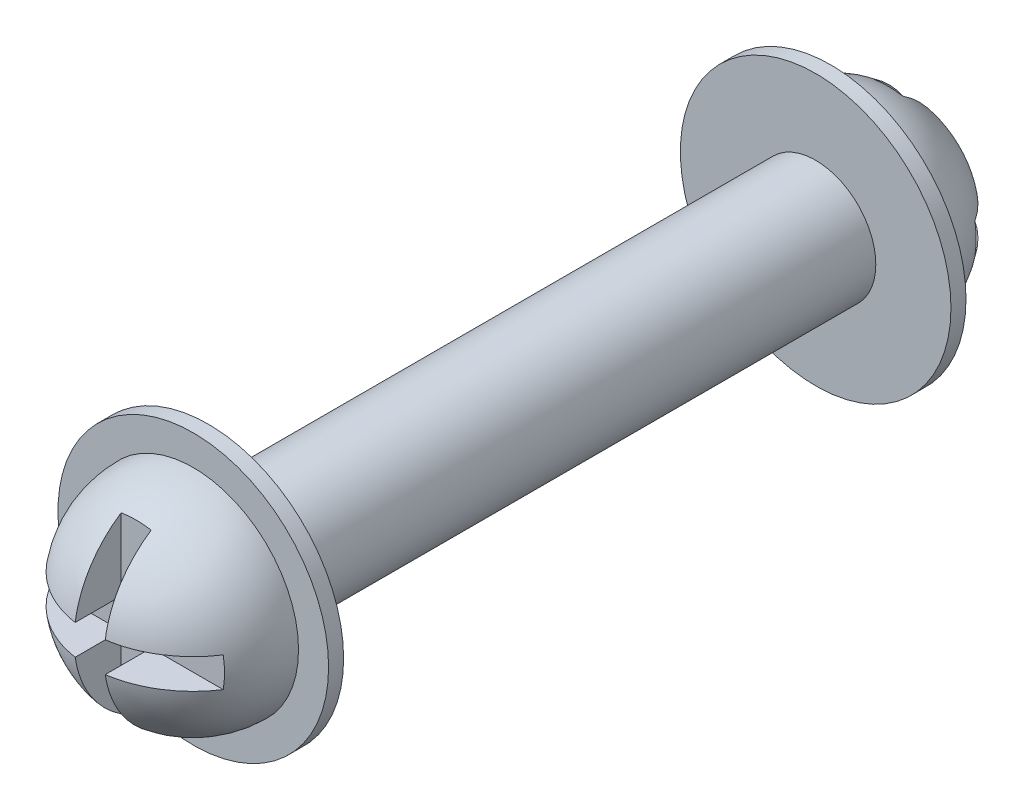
ISO-10303-21;
HEADER;
FILE_DESCRIPTION(('STEP AP214'),'2;1');
FILE_NAME('part.step','',(''),(''),'','','');
FILE_SCHEMA(('AUTOMOTIVE_DESIGN { 1 0 10303 214 1 1 1 1 }'));
ENDSEC;
DATA;
#1=APPLICATION_CONTEXT('core data for automotive mechanical design processes');
#2=APPLICATION_PROTOCOL_DEFINITION('international standard','automotive_design',2000,#1);
#3=PRODUCT_CONTEXT('',#1,'mechanical');
#4=PRODUCT('Part','Part','',(#3));
#5=PRODUCT_RELATED_PRODUCT_CATEGORY('part','',(#4));
#6=PRODUCT_DEFINITION_FORMATION('','',#4);
#7=PRODUCT_DEFINITION_CONTEXT('part definition',#1,'design');
#8=PRODUCT_DEFINITION('design','',#6,#7);
#9=PRODUCT_DEFINITION_SHAPE('','',#8);
#10=(LENGTH_UNIT() NAMED_UNIT(*) SI_UNIT(.MILLI.,.METRE.));
#11=(NAMED_UNIT(*) PLANE_ANGLE_UNIT() SI_UNIT($,.RADIAN.));
#12=(NAMED_UNIT(*) SI_UNIT($,.STERADIAN.) SOLID_ANGLE_UNIT());
#13=UNCERTAINTY_MEASURE_WITH_UNIT(LENGTH_MEASURE(1.E-05),#10,'distance_accuracy_value','');
#14=(GEOMETRIC_REPRESENTATION_CONTEXT(3) GLOBAL_UNCERTAINTY_ASSIGNED_CONTEXT((#13)) GLOBAL_UNIT_ASSIGNED_CONTEXT((#10,
#11,#12)) REPRESENTATION_CONTEXT('',''));
#15=CARTESIAN_POINT('',(0.,0.,0.));
#16=DIRECTION('',(0.,0.,1.));
#17=DIRECTION('',(1.,0.,0.));
#18=AXIS2_PLACEMENT_3D('',#15,#16,#17);
#19=CARTESIAN_POINT('',(-14.2875,1.58749999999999,-46.0375));
#20=DIRECTION('',(0.,1.,0.));
#21=DIRECTION('',(0.,0.,1.));
#22=AXIS2_PLACEMENT_3D('',#19,#20,#21);
#23=PLANE('',#22);
#24=CARTESIAN_POINT('',(0.,1.58749999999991,-33.655));
#25=DIRECTION('',(0.,1.,0.));
#26=DIRECTION('',(0.,0.,1.));
#27=AXIS2_PLACEMENT_3D('',#24,#25,#26);
#28=CIRCLE('',#27,10.9985226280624);
#29=CARTESIAN_POINT('',(-1.5875,1.58749999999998,-44.5383516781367));
#30=VERTEX_POINT('',#29);
#31=CARTESIAN_POINT('',(-9.19654520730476,1.58749999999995,-39.6875));
#32=VERTEX_POINT('',#31);
#33=EDGE_CURVE('E261',#30,#32,#28,.T.);
#34=ORIENTED_EDGE('',*,*,#33,.F.);
#35=DIRECTION('',(0.,0.,1.));
#36=VECTOR('',#35,1.);
#37=CARTESIAN_POINT('',(-1.58749999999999,1.58749999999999,-46.0375));
#38=LINE('',#37,#36);
#39=CARTESIAN_POINT('',(-1.58750000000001,1.58749999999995,-39.6875));
#40=VERTEX_POINT('',#39);
#41=EDGE_CURVE('E174',#30,#40,#38,.T.);
#42=ORIENTED_EDGE('',*,*,#41,.T.);
#43=DIRECTION('',(1.,0.,0.));
#44=VECTOR('',#43,1.);
#45=CARTESIAN_POINT('',(-14.2875,1.58749999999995,-39.6875));
#46=LINE('',#45,#44);
#47=EDGE_CURVE('E207',#32,#40,#46,.T.);
#48=ORIENTED_EDGE('',*,*,#47,.F.);
#49=EDGE_LOOP('',(#34,#42,#48));
#50=FACE_BOUND('',#49,.T.);
#51=ADVANCED_FACE('F32',(#50),#23,.F.);
#52=CARTESIAN_POINT('',(-14.2875,-1.58749999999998,-46.0375));
#53=DIRECTION('',(0.,-1.,0.));
#54=DIRECTION('',(0.,0.,-1.));
#55=AXIS2_PLACEMENT_3D('',#52,#53,#54);
#56=PLANE('',#55);
#57=DIRECTION('',(1.,0.,0.));
#58=VECTOR('',#57,1.);
#59=CARTESIAN_POINT('',(-14.2875,-1.58749999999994,-39.6875));
#60=LINE('',#59,#58);
#61=CARTESIAN_POINT('',(-9.19654520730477,-1.58749999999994,-39.6875));
#62=VERTEX_POINT('',#61);
#63=CARTESIAN_POINT('',(-1.58750000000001,-1.58749999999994,-39.6875));
#64=VERTEX_POINT('',#63);
#65=EDGE_CURVE('E203',#62,#64,#60,.T.);
#66=ORIENTED_EDGE('',*,*,#65,.T.);
#67=DIRECTION('',(0.,0.,-1.));
#68=VECTOR('',#67,1.);
#69=CARTESIAN_POINT('',(-1.58749999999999,-1.58749999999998,-46.0375));
#70=LINE('',#69,#68);
#71=CARTESIAN_POINT('',(-1.5875,-1.58749999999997,-44.5383516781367));
#72=VERTEX_POINT('',#71);
#73=EDGE_CURVE('E276',#64,#72,#70,.T.);
#74=ORIENTED_EDGE('',*,*,#73,.T.);
#75=CARTESIAN_POINT('',(0.,-1.5874999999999,-33.655));
#76=DIRECTION('',(0.,-1.,0.));
#77=DIRECTION('',(0.,0.,-1.));
#78=AXIS2_PLACEMENT_3D('',#75,#76,#77);
#79=CIRCLE('',#78,10.9985226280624);
#80=EDGE_CURVE('E259',#62,#72,#79,.T.);
#81=ORIENTED_EDGE('',*,*,#80,.F.);
#82=EDGE_LOOP('',(#66,#74,#81));
#83=FACE_BOUND('',#82,.T.);
#84=ADVANCED_FACE('F339',(#83),#56,.F.);
#85=CARTESIAN_POINT('',(-14.2875,1.58749999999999,46.0375));
#86=DIRECTION('',(0.,1.,0.));
#87=DIRECTION('',(0.,0.,1.));
#88=AXIS2_PLACEMENT_3D('',#85,#86,#87);
#89=PLANE('',#88);
#90=DIRECTION('',(1.,0.,0.));
#91=VECTOR('',#90,1.);
#92=CARTESIAN_POINT('',(-14.2875,1.58749999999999,39.6875));
#93=LINE('',#92,#91);
#94=CARTESIAN_POINT('',(-9.19654520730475,1.58749999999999,39.6875));
#95=VERTEX_POINT('',#94);
#96=CARTESIAN_POINT('',(-1.58749999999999,1.5875,39.6875));
#97=VERTEX_POINT('',#96);
#98=EDGE_CURVE('E211',#95,#97,#93,.T.);
#99=ORIENTED_EDGE('',*,*,#98,.T.);
#100=DIRECTION('',(0.,0.,1.));
#101=VECTOR('',#100,1.);
#102=CARTESIAN_POINT('',(-1.58749999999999,1.58749999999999,46.0375));
#103=LINE('',#102,#101);
#104=CARTESIAN_POINT('',(-1.58749999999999,1.58749999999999,44.5383516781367));
#105=VERTEX_POINT('',#104);
#106=EDGE_CURVE('E199',#97,#105,#103,.T.);
#107=ORIENTED_EDGE('',*,*,#106,.T.);
#108=CARTESIAN_POINT('',(0.,1.58749999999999,33.655));
#109=DIRECTION('',(0.,1.,0.));
#110=DIRECTION('',(0.,0.,1.));
#111=AXIS2_PLACEMENT_3D('',#108,#109,#110);
#112=CIRCLE('',#111,10.9985226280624);
#113=EDGE_CURVE('E250',#95,#105,#112,.T.);
#114=ORIENTED_EDGE('',*,*,#113,.F.);
#115=EDGE_LOOP('',(#99,#107,#114));
#116=FACE_BOUND('',#115,.T.);
#117=ADVANCED_FACE('F301',(#116),#89,.F.);
#118=CARTESIAN_POINT('',(-14.2875,-1.58750000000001,46.0375));
#119=DIRECTION('',(0.,-1.,0.));
#120=DIRECTION('',(0.,0.,-1.));
#121=AXIS2_PLACEMENT_3D('',#118,#119,#120);
#122=PLANE('',#121);
#123=CARTESIAN_POINT('',(0.,-1.58749999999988,33.655));
#124=DIRECTION('',(0.,-1.,0.));
#125=DIRECTION('',(0.,0.,-1.));
#126=AXIS2_PLACEMENT_3D('',#123,#124,#125);
#127=CIRCLE('',#126,10.9985226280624);
#128=CARTESIAN_POINT('',(-1.58749999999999,-1.58749999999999,44.5383516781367));
#129=VERTEX_POINT('',#128);
#130=CARTESIAN_POINT('',(-9.19654520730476,-1.58749999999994,39.6875));
#131=VERTEX_POINT('',#130);
#132=EDGE_CURVE('E242',#129,#131,#127,.T.);
#133=ORIENTED_EDGE('',*,*,#132,.F.);
#134=DIRECTION('',(0.,0.,-1.));
#135=VECTOR('',#134,1.);
#136=CARTESIAN_POINT('',(-1.58749999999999,-1.58750000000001,46.0375));
#137=LINE('',#136,#135);
#138=CARTESIAN_POINT('',(-1.58749999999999,-1.58749999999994,39.6875));
#139=VERTEX_POINT('',#138);
#140=EDGE_CURVE('E11',#129,#139,#137,.T.);
#141=ORIENTED_EDGE('',*,*,#140,.T.);
#142=DIRECTION('',(1.,0.,0.));
#143=VECTOR('',#142,1.);
#144=CARTESIAN_POINT('',(-14.2875,-1.58749999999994,39.6875));
#145=LINE('',#144,#143);
#146=EDGE_CURVE('E216',#131,#139,#145,.T.);
#147=ORIENTED_EDGE('',*,*,#146,.F.);
#148=EDGE_LOOP('',(#133,#141,#147));
#149=FACE_BOUND('',#148,.T.);
#150=ADVANCED_FACE('F310',(#149),#122,.F.);
#151=CARTESIAN_POINT('',(0.,11.1125,-33.655));
#152=DIRECTION('',(0.,0.,1.));
#153=DIRECTION('',(1.,0.,0.));
#154=AXIS2_PLACEMENT_3D('',#151,#152,#153);
#155=PLANE('',#154);
#156=CARTESIAN_POINT('',(0.,0.,-33.655));
#157=DIRECTION('',(0.,0.,1.));
#158=DIRECTION('',(1.,0.,0.));
#159=AXIS2_PLACEMENT_3D('',#156,#157,#158);
#160=CIRCLE('',#159,14.2875);
#161=CARTESIAN_POINT('',(14.2875,0.,-33.655));
#162=VERTEX_POINT('',#161);
#163=EDGE_CURVE('E239',#162,#162,#160,.T.);
#164=ORIENTED_EDGE('',*,*,#163,.F.);
#165=EDGE_LOOP('',(#164));
#166=FACE_BOUND('',#165,.T.);
#167=CARTESIAN_POINT('',(0.,0.,-33.655));
#168=DIRECTION('',(0.,0.,1.));
#169=DIRECTION('',(1.,0.,0.));
#170=AXIS2_PLACEMENT_3D('',#167,#168,#169);
#171=CIRCLE('',#170,11.1125);
#172=CARTESIAN_POINT('',(11.1125,0.,-33.655));
#173=VERTEX_POINT('',#172);
#174=EDGE_CURVE('E214',#173,#173,#171,.T.);
#175=ORIENTED_EDGE('',*,*,#174,.T.);
#176=EDGE_LOOP('',(#175));
#177=FACE_BOUND('',#176,.T.);
#178=ADVANCED_FACE('F34',(#166,#177),#155,.F.);
#179=CARTESIAN_POINT('',(0.,0.,77.1786132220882));
#180=DIRECTION('',(0.,0.,1.));
#181=DIRECTION('',(1.,0.,0.));
#182=AXIS2_PLACEMENT_3D('',#179,#180,#181);
#183=CYLINDRICAL_SURFACE('',#182,14.2875);
#184=CARTESIAN_POINT('',(0.,0.,-32.0675));
#185=DIRECTION('',(0.,0.,1.));
#186=DIRECTION('',(1.,0.,0.));
#187=AXIS2_PLACEMENT_3D('',#184,#185,#186);
#188=CIRCLE('',#187,14.2875);
#189=CARTESIAN_POINT('',(14.2875,0.,-32.0675));
#190=VERTEX_POINT('',#189);
#191=EDGE_CURVE('E236',#190,#190,#188,.T.);
#192=ORIENTED_EDGE('',*,*,#191,.F.);
#193=EDGE_LOOP('',(#192));
#194=FACE_BOUND('',#193,.T.);
#195=ORIENTED_EDGE('',*,*,#163,.T.);
#196=EDGE_LOOP('',(#195));
#197=FACE_BOUND('',#196,.T.);
#198=ADVANCED_FACE('F365',(#194,#197),#183,.T.);
#199=CARTESIAN_POINT('',(0.,6.35,-32.0675));
#200=DIRECTION('',(0.,0.,-1.));
#201=DIRECTION('',(-1.,0.,0.));
#202=AXIS2_PLACEMENT_3D('',#199,#200,#201);
#203=PLANE('',#202);
#204=CARTESIAN_POINT('',(0.,0.,-32.0675));
#205=DIRECTION('',(0.,0.,1.));
#206=DIRECTION('',(1.,0.,0.));
#207=AXIS2_PLACEMENT_3D('',#204,#205,#206);
#208=CIRCLE('',#207,6.35);
#209=CARTESIAN_POINT('',(6.35,0.,-32.0675));
#210=VERTEX_POINT('',#209);
#211=EDGE_CURVE('E233',#210,#210,#208,.T.);
#212=ORIENTED_EDGE('',*,*,#211,.F.);
#213=EDGE_LOOP('',(#212));
#214=FACE_BOUND('',#213,.T.);
#215=ORIENTED_EDGE('',*,*,#191,.T.);
#216=EDGE_LOOP('',(#215));
#217=FACE_BOUND('',#216,.T.);
#218=ADVANCED_FACE('F393',(#214,#217),#203,.F.);
#219=CARTESIAN_POINT('',(0.,0.,77.1786132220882));
#220=DIRECTION('',(0.,0.,1.));
#221=DIRECTION('',(1.,0.,0.));
#222=AXIS2_PLACEMENT_3D('',#219,#220,#221);
#223=CYLINDRICAL_SURFACE('',#222,6.35);
#224=CARTESIAN_POINT('',(0.,0.,32.0675));
#225=DIRECTION('',(0.,0.,1.));
#226=DIRECTION('',(1.,0.,0.));
#227=AXIS2_PLACEMENT_3D('',#224,#225,#226);
#228=CIRCLE('',#227,6.35);
#229=CARTESIAN_POINT('',(6.35,0.,32.0675));
#230=VERTEX_POINT('',#229);
#231=EDGE_CURVE('E230',#230,#230,#228,.T.);
#232=ORIENTED_EDGE('',*,*,#231,.F.);
#233=EDGE_LOOP('',(#232));
#234=FACE_BOUND('',#233,.T.);
#235=ORIENTED_EDGE('',*,*,#211,.T.);
#236=EDGE_LOOP('',(#235));
#237=FACE_BOUND('',#236,.T.);
#238=ADVANCED_FACE('F389',(#234,#237),#223,.T.);
#239=CARTESIAN_POINT('',(0.,6.35,32.0675));
#240=DIRECTION('',(0.,0.,1.));
#241=DIRECTION('',(1.,0.,0.));
#242=AXIS2_PLACEMENT_3D('',#239,#240,#241);
#243=PLANE('',#242);
#244=CARTESIAN_POINT('',(0.,0.,32.0675));
#245=DIRECTION('',(0.,0.,1.));
#246=DIRECTION('',(1.,0.,0.));
#247=AXIS2_PLACEMENT_3D('',#244,#245,#246);
#248=CIRCLE('',#247,14.2875);
#249=CARTESIAN_POINT('',(14.2875,0.,32.0675));
#250=VERTEX_POINT('',#249);
#251=EDGE_CURVE('E227',#250,#250,#248,.T.);
#252=ORIENTED_EDGE('',*,*,#251,.F.);
#253=EDGE_LOOP('',(#252));
#254=FACE_BOUND('',#253,.T.);
#255=ORIENTED_EDGE('',*,*,#231,.T.);
#256=EDGE_LOOP('',(#255));
#257=FACE_BOUND('',#256,.T.);
#258=ADVANCED_FACE('F385',(#254,#257),#243,.F.);
#259=CARTESIAN_POINT('',(0.,0.,77.1786132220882));
#260=DIRECTION('',(0.,0.,1.));
#261=DIRECTION('',(1.,0.,0.));
#262=AXIS2_PLACEMENT_3D('',#259,#260,#261);
#263=CYLINDRICAL_SURFACE('',#262,14.2875);
#264=CARTESIAN_POINT('',(0.,0.,33.655));
#265=DIRECTION('',(0.,0.,1.));
#266=DIRECTION('',(1.,0.,0.));
#267=AXIS2_PLACEMENT_3D('',#264,#265,#266);
#268=CIRCLE('',#267,14.2875);
#269=CARTESIAN_POINT('',(14.2875,0.,33.655));
#270=VERTEX_POINT('',#269);
#271=EDGE_CURVE('E224',#270,#270,#268,.T.);
#272=ORIENTED_EDGE('',*,*,#271,.F.);
#273=EDGE_LOOP('',(#272));
#274=FACE_BOUND('',#273,.T.);
#275=ORIENTED_EDGE('',*,*,#251,.T.);
#276=EDGE_LOOP('',(#275));
#277=FACE_BOUND('',#276,.T.);
#278=ADVANCED_FACE('F381',(#274,#277),#263,.T.);
#279=CARTESIAN_POINT('',(0.,11.1125,33.655));
#280=DIRECTION('',(0.,0.,-1.));
#281=DIRECTION('',(-1.,0.,0.));
#282=AXIS2_PLACEMENT_3D('',#279,#280,#281);
#283=PLANE('',#282);
#284=CARTESIAN_POINT('',(0.,0.,33.655));
#285=DIRECTION('',(0.,0.,1.));
#286=DIRECTION('',(1.,0.,0.));
#287=AXIS2_PLACEMENT_3D('',#284,#285,#286);
#288=CIRCLE('',#287,11.1125);
#289=CARTESIAN_POINT('',(11.1125,0.,33.655));
#290=VERTEX_POINT('',#289);
#291=EDGE_CURVE('E221',#290,#290,#288,.T.);
#292=ORIENTED_EDGE('',*,*,#291,.F.);
#293=EDGE_LOOP('',(#292));
#294=FACE_BOUND('',#293,.T.);
#295=ORIENTED_EDGE('',*,*,#271,.T.);
#296=EDGE_LOOP('',(#295));
#297=FACE_BOUND('',#296,.T.);
#298=ADVANCED_FACE('F376',(#294,#297),#283,.F.);
#299=CARTESIAN_POINT('',(0.,0.,33.655));
#300=DIRECTION('',(0.,0.,1.));
#301=DIRECTION('',(0.,1.,0.));
#302=AXIS2_PLACEMENT_3D('',#299,#300,#301);
#303=SPHERICAL_SURFACE('',#302,11.1125);
#304=ORIENTED_EDGE('',*,*,#113,.T.);
#305=CARTESIAN_POINT('',(-1.58749999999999,0.,33.655));
#306=DIRECTION('',(-1.,0.,0.));
#307=DIRECTION('',(0.,0.,1.));
#308=AXIS2_PLACEMENT_3D('',#305,#306,#307);
#309=CIRCLE('',#308,10.9985226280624);
#310=CARTESIAN_POINT('',(-1.58749999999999,9.19654520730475,39.6875));
#311=VERTEX_POINT('',#310);
#312=EDGE_CURVE('E200',#105,#311,#309,.T.);
#313=ORIENTED_EDGE('',*,*,#312,.T.);
#314=CARTESIAN_POINT('',(0.,0.,39.6875));
#315=DIRECTION('',(0.,0.,-1.));
#316=DIRECTION('',(-1.,0.,0.));
#317=AXIS2_PLACEMENT_3D('',#314,#315,#316);
#318=CIRCLE('',#317,9.33255592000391);
#319=CARTESIAN_POINT('',(1.58750000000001,9.19654520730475,39.6875));
#320=VERTEX_POINT('',#319);
#321=EDGE_CURVE('E195',#311,#320,#318,.T.);
#322=ORIENTED_EDGE('',*,*,#321,.T.);
#323=CARTESIAN_POINT('',(1.58750000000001,0.,33.655));
#324=DIRECTION('',(1.,0.,0.));
#325=DIRECTION('',(0.,0.,-1.));
#326=AXIS2_PLACEMENT_3D('',#323,#324,#325);
#327=CIRCLE('',#326,10.9985226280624);
#328=CARTESIAN_POINT('',(1.58750000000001,1.58749999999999,44.5383516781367));
#329=VERTEX_POINT('',#328);
#330=EDGE_CURVE('E189',#320,#329,#327,.T.);
#331=ORIENTED_EDGE('',*,*,#330,.T.);
#332=CARTESIAN_POINT('',(9.19654520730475,1.58749999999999,39.6875));
#333=VERTEX_POINT('',#332);
#334=EDGE_CURVE('E254',#329,#333,#112,.T.);
#335=ORIENTED_EDGE('',*,*,#334,.T.);
#336=CARTESIAN_POINT('',(0.,0.,39.6875));
#337=DIRECTION('',(0.,0.,-1.));
#338=DIRECTION('',(-1.,0.,0.));
#339=AXIS2_PLACEMENT_3D('',#336,#337,#338);
#340=CIRCLE('',#339,9.33255592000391);
#341=CARTESIAN_POINT('',(9.19654520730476,-1.58749999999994,39.6875));
#342=VERTEX_POINT('',#341);
#343=EDGE_CURVE('E249',#333,#342,#340,.T.);
#344=ORIENTED_EDGE('',*,*,#343,.T.);
#345=CARTESIAN_POINT('',(1.58750000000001,-1.58749999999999,44.5383516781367));
#346=VERTEX_POINT('',#345);
#347=EDGE_CURVE('E243',#342,#346,#127,.T.);
#348=ORIENTED_EDGE('',*,*,#347,.T.);
#349=CARTESIAN_POINT('',(1.58750000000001,-9.19654520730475,39.6875));
#350=VERTEX_POINT('',#349);
#351=EDGE_CURVE('E185',#346,#350,#327,.T.);
#352=ORIENTED_EDGE('',*,*,#351,.T.);
#353=CARTESIAN_POINT('',(-1.58749999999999,-9.19654520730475,39.6875));
#354=VERTEX_POINT('',#353);
#355=EDGE_CURVE('E192',#350,#354,#318,.T.);
#356=ORIENTED_EDGE('',*,*,#355,.T.);
#357=EDGE_CURVE('E196',#354,#129,#309,.T.);
#358=ORIENTED_EDGE('',*,*,#357,.T.);
#359=ORIENTED_EDGE('',*,*,#132,.T.);
#360=EDGE_CURVE('E246',#131,#95,#340,.T.);
#361=ORIENTED_EDGE('',*,*,#360,.T.);
#362=EDGE_LOOP('',(#304,#313,#322,#331,#335,#344,#348,#352,#356,#358,#359,#361));
#363=FACE_BOUND('',#362,.T.);
#364=ORIENTED_EDGE('',*,*,#291,.T.);
#365=EDGE_LOOP('',(#364));
#366=FACE_BOUND('',#365,.T.);
#367=ADVANCED_FACE('F294',(#363,#366),#303,.T.);
#368=CARTESIAN_POINT('',(0.,0.,-33.655));
#369=DIRECTION('',(0.,0.,1.));
#370=DIRECTION('',(0.,-1.,0.));
#371=AXIS2_PLACEMENT_3D('',#368,#369,#370);
#372=SPHERICAL_SURFACE('',#371,11.1125);
#373=CARTESIAN_POINT('',(0.,0.,-39.6875));
#374=DIRECTION('',(0.,0.,1.));
#375=DIRECTION('',(1.,0.,0.));
#376=AXIS2_PLACEMENT_3D('',#373,#374,#375);
#377=CIRCLE('',#376,9.33255592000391);
#378=CARTESIAN_POINT('',(1.58750000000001,9.19654520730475,-39.6875));
#379=VERTEX_POINT('',#378);
#380=CARTESIAN_POINT('',(-1.58750000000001,9.19654520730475,-39.6875));
#381=VERTEX_POINT('',#380);
#382=EDGE_CURVE('E169',#379,#381,#377,.T.);
#383=ORIENTED_EDGE('',*,*,#382,.T.);
#384=CARTESIAN_POINT('',(-1.58750000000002,0.,-33.655));
#385=DIRECTION('',(-1.,0.,0.));
#386=DIRECTION('',(0.,0.,1.));
#387=AXIS2_PLACEMENT_3D('',#384,#385,#386);
#388=CIRCLE('',#387,10.9985226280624);
#389=EDGE_CURVE('E170',#381,#30,#388,.T.);
#390=ORIENTED_EDGE('',*,*,#389,.T.);
#391=ORIENTED_EDGE('',*,*,#33,.T.);
#392=CARTESIAN_POINT('',(0.,0.,-39.6875));
#393=DIRECTION('',(0.,0.,1.));
#394=DIRECTION('',(1.,0.,0.));
#395=AXIS2_PLACEMENT_3D('',#392,#393,#394);
#396=CIRCLE('',#395,9.33255592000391);
#397=EDGE_CURVE('E258',#32,#62,#396,.T.);
#398=ORIENTED_EDGE('',*,*,#397,.T.);
#399=ORIENTED_EDGE('',*,*,#80,.T.);
#400=CARTESIAN_POINT('',(-1.58750000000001,-9.19654520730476,-39.6875));
#401=VERTEX_POINT('',#400);
#402=EDGE_CURVE('E168',#72,#401,#388,.T.);
#403=ORIENTED_EDGE('',*,*,#402,.T.);
#404=CARTESIAN_POINT('',(1.58750000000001,-9.19654520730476,-39.6875));
#405=VERTEX_POINT('',#404);
#406=EDGE_CURVE('E158',#401,#405,#377,.T.);
#407=ORIENTED_EDGE('',*,*,#406,.T.);
#408=CARTESIAN_POINT('',(1.58750000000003,0.,-33.655));
#409=DIRECTION('',(1.,0.,0.));
#410=DIRECTION('',(0.,0.,-1.));
#411=AXIS2_PLACEMENT_3D('',#408,#409,#410);
#412=CIRCLE('',#411,10.9985226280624);
#413=CARTESIAN_POINT('',(1.5875,-1.58749999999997,-44.5383516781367));
#414=VERTEX_POINT('',#413);
#415=EDGE_CURVE('E144',#405,#414,#412,.T.);
#416=ORIENTED_EDGE('',*,*,#415,.T.);
#417=CARTESIAN_POINT('',(9.19654520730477,-1.58749999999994,-39.6875));
#418=VERTEX_POINT('',#417);
#419=EDGE_CURVE('E257',#414,#418,#79,.T.);
#420=ORIENTED_EDGE('',*,*,#419,.T.);
#421=CARTESIAN_POINT('',(9.19654520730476,1.58749999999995,-39.6875));
#422=VERTEX_POINT('',#421);
#423=EDGE_CURVE('E253',#418,#422,#396,.T.);
#424=ORIENTED_EDGE('',*,*,#423,.T.);
#425=CARTESIAN_POINT('',(1.5875,1.58749999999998,-44.5383516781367));
#426=VERTEX_POINT('',#425);
#427=EDGE_CURVE('E262',#422,#426,#28,.T.);
#428=ORIENTED_EDGE('',*,*,#427,.T.);
#429=EDGE_CURVE('E155',#426,#379,#412,.T.);
#430=ORIENTED_EDGE('',*,*,#429,.T.);
#431=EDGE_LOOP('',(#383,#390,#391,#398,#399,#403,#407,#416,#420,#424,#428,#430));
#432=FACE_BOUND('',#431,.T.);
#433=ORIENTED_EDGE('',*,*,#174,.F.);
#434=EDGE_LOOP('',(#433));
#435=FACE_BOUND('',#434,.T.);
#436=ADVANCED_FACE('F165',(#432,#435),#372,.T.);
#437=ORIENTED_EDGE('',*,*,#334,.F.);
#438=DIRECTION('',(0.,0.,-1.));
#439=VECTOR('',#438,1.);
#440=CARTESIAN_POINT('',(1.58750000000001,1.58749999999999,46.0375));
#441=LINE('',#440,#439);
#442=CARTESIAN_POINT('',(1.58750000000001,1.58749999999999,39.6875));
#443=VERTEX_POINT('',#442);
#444=EDGE_CURVE('E188',#329,#443,#441,.T.);
#445=ORIENTED_EDGE('',*,*,#444,.T.);
#446=EDGE_CURVE('E215',#443,#333,#93,.T.);
#447=ORIENTED_EDGE('',*,*,#446,.T.);
#448=EDGE_LOOP('',(#437,#445,#447));
#449=FACE_BOUND('',#448,.T.);
#450=ADVANCED_FACE('F323',(#449),#89,.F.);
#451=CARTESIAN_POINT('',(-14.2875,1.58749999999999,39.6875));
#452=DIRECTION('',(0.,0.,-1.));
#453=DIRECTION('',(-1.,0.,0.));
#454=AXIS2_PLACEMENT_3D('',#451,#452,#453);
#455=PLANE('',#454);
#456=ORIENTED_EDGE('',*,*,#446,.F.);
#457=DIRECTION('',(0.,1.,0.));
#458=VECTOR('',#457,1.);
#459=CARTESIAN_POINT('',(1.58750000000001,-14.2875,39.6875));
#460=LINE('',#459,#458);
#461=EDGE_CURVE('E172',#443,#320,#460,.T.);
#462=ORIENTED_EDGE('',*,*,#461,.T.);
#463=ORIENTED_EDGE('',*,*,#321,.F.);
#464=DIRECTION('',(0.,1.,0.));
#465=VECTOR('',#464,1.);
#466=CARTESIAN_POINT('',(-1.58749999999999,-14.2875,39.6875));
#467=LINE('',#466,#465);
#468=EDGE_CURVE('E178',#97,#311,#467,.T.);
#469=ORIENTED_EDGE('',*,*,#468,.F.);
#470=ORIENTED_EDGE('',*,*,#98,.F.);
#471=ORIENTED_EDGE('',*,*,#360,.F.);
#472=ORIENTED_EDGE('',*,*,#146,.T.);
#473=EDGE_CURVE('E181',#354,#139,#467,.T.);
#474=ORIENTED_EDGE('',*,*,#473,.F.);
#475=ORIENTED_EDGE('',*,*,#355,.F.);
#476=CARTESIAN_POINT('',(1.58750000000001,-1.58749999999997,39.6875));
#477=VERTEX_POINT('',#476);
#478=EDGE_CURVE('E182',#350,#477,#460,.T.);
#479=ORIENTED_EDGE('',*,*,#478,.T.);
#480=EDGE_CURVE('E206',#477,#342,#145,.T.);
#481=ORIENTED_EDGE('',*,*,#480,.T.);
#482=ORIENTED_EDGE('',*,*,#343,.F.);
#483=EDGE_LOOP('',(#456,#462,#463,#469,#470,#471,#472,#474,#475,#479,#481,#482));
#484=FACE_BOUND('',#483,.T.);
#485=ADVANCED_FACE('F306',(#484),#455,.F.);
#486=ORIENTED_EDGE('',*,*,#480,.F.);
#487=DIRECTION('',(0.,0.,1.));
#488=VECTOR('',#487,1.);
#489=CARTESIAN_POINT('',(1.58750000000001,-1.58750000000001,46.0375));
#490=LINE('',#489,#488);
#491=EDGE_CURVE('E40',#477,#346,#490,.T.);
#492=ORIENTED_EDGE('',*,*,#491,.T.);
#493=ORIENTED_EDGE('',*,*,#347,.F.);
#494=EDGE_LOOP('',(#486,#492,#493));
#495=FACE_BOUND('',#494,.T.);
#496=ADVANCED_FACE('F319',(#495),#122,.F.);
#497=CARTESIAN_POINT('',(1.58750000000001,1.58749999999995,-39.6875));
#498=VERTEX_POINT('',#497);
#499=EDGE_CURVE('E210',#498,#422,#46,.T.);
#500=ORIENTED_EDGE('',*,*,#499,.F.);
#501=DIRECTION('',(0.,0.,-1.));
#502=VECTOR('',#501,1.);
#503=CARTESIAN_POINT('',(1.58749999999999,1.58749999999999,-46.0375));
#504=LINE('',#503,#502);
#505=EDGE_CURVE('E153',#498,#426,#504,.T.);
#506=ORIENTED_EDGE('',*,*,#505,.T.);
#507=ORIENTED_EDGE('',*,*,#427,.F.);
#508=EDGE_LOOP('',(#500,#506,#507));
#509=FACE_BOUND('',#508,.T.);
#510=ADVANCED_FACE('F290',(#509),#23,.F.);
#511=ORIENTED_EDGE('',*,*,#419,.F.);
#512=DIRECTION('',(0.,0.,1.));
#513=VECTOR('',#512,1.);
#514=CARTESIAN_POINT('',(1.58749999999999,-1.58749999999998,-46.0375));
#515=LINE('',#514,#513);
#516=CARTESIAN_POINT('',(1.58750000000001,-1.58749999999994,-39.6875));
#517=VERTEX_POINT('',#516);
#518=EDGE_CURVE('E149',#414,#517,#515,.T.);
#519=ORIENTED_EDGE('',*,*,#518,.T.);
#520=EDGE_CURVE('E161',#517,#418,#60,.T.);
#521=ORIENTED_EDGE('',*,*,#520,.T.);
#522=EDGE_LOOP('',(#511,#519,#521));
#523=FACE_BOUND('',#522,.T.);
#524=ADVANCED_FACE('F345',(#523),#56,.F.);
#525=CARTESIAN_POINT('',(-14.2875,1.58749999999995,-39.6875));
#526=DIRECTION('',(0.,0.,1.));
#527=DIRECTION('',(1.,0.,0.));
#528=AXIS2_PLACEMENT_3D('',#525,#526,#527);
#529=PLANE('',#528);
#530=ORIENTED_EDGE('',*,*,#520,.F.);
#531=DIRECTION('',(0.,1.,0.));
#532=VECTOR('',#531,1.);
#533=CARTESIAN_POINT('',(1.58750000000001,-14.2875,-39.6875));
#534=LINE('',#533,#532);
#535=EDGE_CURVE('E147',#405,#517,#534,.T.);
#536=ORIENTED_EDGE('',*,*,#535,.F.);
#537=ORIENTED_EDGE('',*,*,#406,.F.);
#538=DIRECTION('',(0.,1.,0.));
#539=VECTOR('',#538,1.);
#540=CARTESIAN_POINT('',(-1.58750000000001,-14.2875,-39.6875));
#541=LINE('',#540,#539);
#542=EDGE_CURVE('E47',#401,#64,#541,.T.);
#543=ORIENTED_EDGE('',*,*,#542,.T.);
#544=ORIENTED_EDGE('',*,*,#65,.F.);
#545=ORIENTED_EDGE('',*,*,#397,.F.);
#546=ORIENTED_EDGE('',*,*,#47,.T.);
#547=EDGE_CURVE('E283',#40,#381,#541,.T.);
#548=ORIENTED_EDGE('',*,*,#547,.T.);
#549=ORIENTED_EDGE('',*,*,#382,.F.);
#550=EDGE_CURVE('E54',#498,#379,#534,.T.);
#551=ORIENTED_EDGE('',*,*,#550,.F.);
#552=ORIENTED_EDGE('',*,*,#499,.T.);
#553=ORIENTED_EDGE('',*,*,#423,.F.);
#554=EDGE_LOOP('',(#530,#536,#537,#543,#544,#545,#546,#548,#549,#551,#552,#553));
#555=FACE_BOUND('',#554,.T.);
#556=ADVANCED_FACE('F157',(#555),#529,.F.);
#557=CARTESIAN_POINT('',(1.58750000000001,-14.2875,47.3075));
#558=DIRECTION('',(1.,0.,0.));
#559=DIRECTION('',(0.,0.,-1.));
#560=AXIS2_PLACEMENT_3D('',#557,#558,#559);
#561=PLANE('',#560);
#562=ORIENTED_EDGE('',*,*,#491,.F.);
#563=ORIENTED_EDGE('',*,*,#478,.F.);
#564=ORIENTED_EDGE('',*,*,#351,.F.);
#565=EDGE_LOOP('',(#562,#563,#564));
#566=FACE_BOUND('',#565,.T.);
#567=ADVANCED_FACE('F317',(#566),#561,.F.);
#568=CARTESIAN_POINT('',(-1.58749999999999,-14.2875,47.3075));
#569=DIRECTION('',(-1.,0.,0.));
#570=DIRECTION('',(0.,0.,1.));
#571=AXIS2_PLACEMENT_3D('',#568,#569,#570);
#572=PLANE('',#571);
#573=ORIENTED_EDGE('',*,*,#473,.T.);
#574=ORIENTED_EDGE('',*,*,#140,.F.);
#575=ORIENTED_EDGE('',*,*,#357,.F.);
#576=EDGE_LOOP('',(#573,#574,#575));
#577=FACE_BOUND('',#576,.T.);
#578=ADVANCED_FACE('F334',(#577),#572,.F.);
#579=ORIENTED_EDGE('',*,*,#106,.F.);
#580=ORIENTED_EDGE('',*,*,#468,.T.);
#581=ORIENTED_EDGE('',*,*,#312,.F.);
#582=EDGE_LOOP('',(#579,#580,#581));
#583=FACE_BOUND('',#582,.T.);
#584=ADVANCED_FACE('F298',(#583),#572,.F.);
#585=ORIENTED_EDGE('',*,*,#461,.F.);
#586=ORIENTED_EDGE('',*,*,#444,.F.);
#587=ORIENTED_EDGE('',*,*,#330,.F.);
#588=EDGE_LOOP('',(#585,#586,#587));
#589=FACE_BOUND('',#588,.T.);
#590=ADVANCED_FACE('F325',(#589),#561,.F.);
#591=CARTESIAN_POINT('',(1.58749999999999,-14.2875,-47.3075));
#592=DIRECTION('',(1.,0.,0.));
#593=DIRECTION('',(0.,0.,-1.));
#594=AXIS2_PLACEMENT_3D('',#591,#592,#593);
#595=PLANE('',#594);
#596=ORIENTED_EDGE('',*,*,#535,.T.);
#597=ORIENTED_EDGE('',*,*,#518,.F.);
#598=ORIENTED_EDGE('',*,*,#415,.F.);
#599=EDGE_LOOP('',(#596,#597,#598));
#600=FACE_BOUND('',#599,.T.);
#601=ADVANCED_FACE('F146',(#600),#595,.F.);
#602=CARTESIAN_POINT('',(-1.58749999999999,-14.2875,-47.3075));
#603=DIRECTION('',(-1.,0.,0.));
#604=DIRECTION('',(0.,0.,1.));
#605=AXIS2_PLACEMENT_3D('',#602,#603,#604);
#606=PLANE('',#605);
#607=ORIENTED_EDGE('',*,*,#73,.F.);
#608=ORIENTED_EDGE('',*,*,#542,.F.);
#609=ORIENTED_EDGE('',*,*,#402,.F.);
#610=EDGE_LOOP('',(#607,#608,#609));
#611=FACE_BOUND('',#610,.T.);
#612=ADVANCED_FACE('F332',(#611),#606,.F.);
#613=ORIENTED_EDGE('',*,*,#547,.F.);
#614=ORIENTED_EDGE('',*,*,#41,.F.);
#615=ORIENTED_EDGE('',*,*,#389,.F.);
#616=EDGE_LOOP('',(#613,#614,#615));
#617=FACE_BOUND('',#616,.T.);
#618=ADVANCED_FACE('F511',(#617),#606,.F.);
#619=ORIENTED_EDGE('',*,*,#505,.F.);
#620=ORIENTED_EDGE('',*,*,#550,.T.);
#621=ORIENTED_EDGE('',*,*,#429,.F.);
#622=EDGE_LOOP('',(#619,#620,#621));
#623=FACE_BOUND('',#622,.T.);
#624=ADVANCED_FACE('F286',(#623),#595,.F.);
#625=CLOSED_SHELL('',(#51,#84,#117,#150,#178,#198,#218,#238,#258,#278,#298,#367,#436,#450,#485,
#496,#510,#524,#556,#567,#578,#584,#590,#601,#612,#618,#624));
#626=MANIFOLD_SOLID_BREP('B2',#625);
#627=ADVANCED_BREP_SHAPE_REPRESENTATION('',(#18,#626),#14);
#628=SHAPE_DEFINITION_REPRESENTATION(#9,#627);
ENDSEC;
END-ISO-10303-21;
